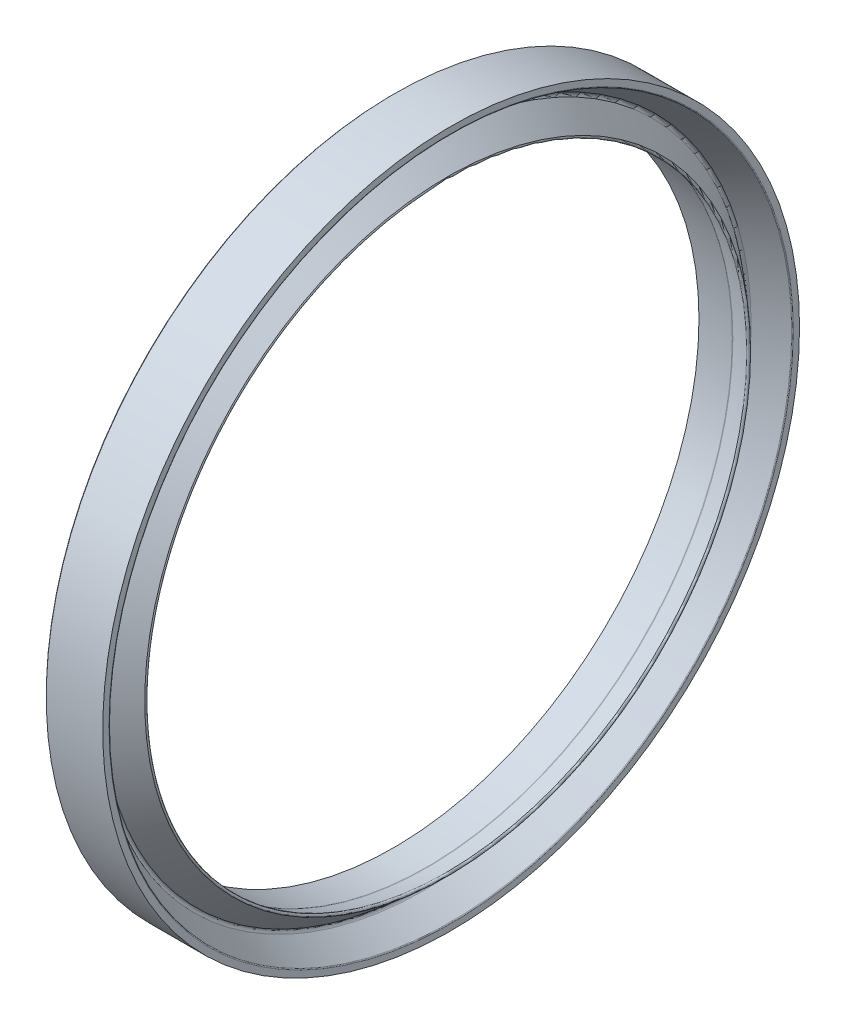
ISO-10303-21;
HEADER;
FILE_DESCRIPTION(('STEP AP214'),'2;1');
FILE_NAME('part.step','',(''),(''),'','','');
FILE_SCHEMA(('AUTOMOTIVE_DESIGN { 1 0 10303 214 1 1 1 1 }'));
ENDSEC;
DATA;
#1=APPLICATION_CONTEXT('core data for automotive mechanical design processes');
#2=APPLICATION_PROTOCOL_DEFINITION('international standard','automotive_design',2000,#1);
#3=PRODUCT_CONTEXT('',#1,'mechanical');
#4=PRODUCT('Part','Part','',(#3));
#5=PRODUCT_RELATED_PRODUCT_CATEGORY('part','',(#4));
#6=PRODUCT_DEFINITION_FORMATION('','',#4);
#7=PRODUCT_DEFINITION_CONTEXT('part definition',#1,'design');
#8=PRODUCT_DEFINITION('design','',#6,#7);
#9=PRODUCT_DEFINITION_SHAPE('','',#8);
#10=(LENGTH_UNIT() NAMED_UNIT(*) SI_UNIT(.MILLI.,.METRE.));
#11=(NAMED_UNIT(*) PLANE_ANGLE_UNIT() SI_UNIT($,.RADIAN.));
#12=(NAMED_UNIT(*) SI_UNIT($,.STERADIAN.) SOLID_ANGLE_UNIT());
#13=UNCERTAINTY_MEASURE_WITH_UNIT(LENGTH_MEASURE(1.E-05),#10,'distance_accuracy_value','');
#14=(GEOMETRIC_REPRESENTATION_CONTEXT(3) GLOBAL_UNCERTAINTY_ASSIGNED_CONTEXT((#13)) GLOBAL_UNIT_ASSIGNED_CONTEXT((#10,
#11,#12)) REPRESENTATION_CONTEXT('',''));
#15=CARTESIAN_POINT('',(0.,0.,0.));
#16=DIRECTION('',(0.,0.,1.));
#17=DIRECTION('',(1.,0.,0.));
#18=AXIS2_PLACEMENT_3D('',#15,#16,#17);
#19=CARTESIAN_POINT('',(-1.6123534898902,0.,0.));
#20=DIRECTION('',(1.,0.,0.));
#21=DIRECTION('',(0.,0.,-1.));
#22=AXIS2_PLACEMENT_3D('',#19,#20,#21);
#23=CYLINDRICAL_SURFACE('',#22,29.);
#24=CARTESIAN_POINT('',(-2.82937380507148,0.,0.));
#25=DIRECTION('',(1.,0.,0.));
#26=DIRECTION('',(0.,0.,-1.));
#27=AXIS2_PLACEMENT_3D('',#24,#25,#26);
#28=CIRCLE('',#27,29.);
#29=CARTESIAN_POINT('',(-2.82937380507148,0.,-29.));
#30=VERTEX_POINT('',#29);
#31=EDGE_CURVE('E10',#30,#30,#28,.T.);
#32=ORIENTED_EDGE('',*,*,#31,.F.);
#33=EDGE_LOOP('',(#32));
#34=FACE_BOUND('',#33,.T.);
#35=CARTESIAN_POINT('',(-7.52937380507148,0.,0.));
#36=DIRECTION('',(1.,0.,0.));
#37=DIRECTION('',(0.,0.,-1.));
#38=AXIS2_PLACEMENT_3D('',#35,#36,#37);
#39=CIRCLE('',#38,29.);
#40=CARTESIAN_POINT('',(-7.52937380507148,0.,-29.));
#41=VERTEX_POINT('',#40);
#42=EDGE_CURVE('E70',#41,#41,#39,.T.);
#43=ORIENTED_EDGE('',*,*,#42,.T.);
#44=EDGE_LOOP('',(#43));
#45=FACE_BOUND('',#44,.T.);
#46=ADVANCED_FACE('F30',(#34,#45),#23,.T.);
#47=CARTESIAN_POINT('',(-2.82937380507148,-29.,0.));
#48=DIRECTION('',(-1.,0.,0.));
#49=DIRECTION('',(0.,0.,1.));
#50=AXIS2_PLACEMENT_3D('',#47,#48,#49);
#51=PLANE('',#50);
#52=CARTESIAN_POINT('',(-2.82937380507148,0.,0.));
#53=DIRECTION('',(1.,0.,0.));
#54=DIRECTION('',(0.,0.,-1.));
#55=AXIS2_PLACEMENT_3D('',#52,#53,#54);
#56=CIRCLE('',#55,28.4814331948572);
#57=CARTESIAN_POINT('',(-2.82937380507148,0.,-28.4814331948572));
#58=VERTEX_POINT('',#57);
#59=EDGE_CURVE('E36',#58,#58,#56,.T.);
#60=ORIENTED_EDGE('',*,*,#59,.F.);
#61=EDGE_LOOP('',(#60));
#62=FACE_BOUND('',#61,.T.);
#63=ORIENTED_EDGE('',*,*,#31,.T.);
#64=EDGE_LOOP('',(#63));
#65=FACE_BOUND('',#64,.T.);
#66=ADVANCED_FACE('F131',(#62,#65),#51,.F.);
#67=CARTESIAN_POINT('',(-2.92937380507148,0.,0.));
#68=DIRECTION('',(1.,0.,0.));
#69=DIRECTION('',(0.,0.,-1.));
#70=AXIS2_PLACEMENT_3D('',#67,#68,#69);
#71=TOROIDAL_SURFACE('',#70,28.4814331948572,0.0999999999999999);
#72=CARTESIAN_POINT('',(-2.87937380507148,0.,0.));
#73=DIRECTION('',(1.,0.,0.));
#74=DIRECTION('',(0.,0.,-1.));
#75=AXIS2_PLACEMENT_3D('',#72,#73,#74);
#76=CIRCLE('',#75,28.3948306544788);
#77=CARTESIAN_POINT('',(-2.87937380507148,0.,-28.3948306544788));
#78=VERTEX_POINT('',#77);
#79=EDGE_CURVE('E40',#78,#78,#76,.T.);
#80=ORIENTED_EDGE('',*,*,#79,.F.);
#81=EDGE_LOOP('',(#80));
#82=FACE_BOUND('',#81,.T.);
#83=ORIENTED_EDGE('',*,*,#59,.T.);
#84=EDGE_LOOP('',(#83));
#85=FACE_BOUND('',#84,.T.);
#86=ADVANCED_FACE('F126',(#82,#85),#71,.T.);
#87=CARTESIAN_POINT('',(-2.87937380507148,0.,0.));
#88=DIRECTION('',(1.,0.,0.));
#89=DIRECTION('',(0.,0.,-1.));
#90=AXIS2_PLACEMENT_3D('',#87,#88,#89);
#91=CONICAL_SURFACE('',#90,28.3948306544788,0.523598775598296);
#92=CARTESIAN_POINT('',(-5.01881825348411,0.,0.));
#93=DIRECTION('',(1.,0.,0.));
#94=DIRECTION('',(0.,0.,-1.));
#95=AXIS2_PLACEMENT_3D('',#92,#93,#94);
#96=CIRCLE('',#95,27.1596218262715);
#97=CARTESIAN_POINT('',(-5.01881825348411,0.,-27.1596218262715));
#98=VERTEX_POINT('',#97);
#99=EDGE_CURVE('E44',#98,#98,#96,.T.);
#100=ORIENTED_EDGE('',*,*,#99,.F.);
#101=EDGE_LOOP('',(#100));
#102=FACE_BOUND('',#101,.T.);
#103=ORIENTED_EDGE('',*,*,#79,.T.);
#104=EDGE_LOOP('',(#103));
#105=FACE_BOUND('',#104,.T.);
#106=ADVANCED_FACE('F120',(#102,#105),#91,.F.);
#107=CARTESIAN_POINT('',(-4.91881825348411,0.,0.));
#108=DIRECTION('',(1.,0.,0.));
#109=DIRECTION('',(0.,0.,-1.));
#110=AXIS2_PLACEMENT_3D('',#107,#108,#109);
#111=TOROIDAL_SURFACE('',#110,26.9864167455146,0.200000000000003);
#112=CARTESIAN_POINT('',(-5.04737577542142,0.,0.));
#113=DIRECTION('',(1.,0.,0.));
#114=DIRECTION('',(0.,0.,-1.));
#115=AXIS2_PLACEMENT_3D('',#112,#113,#114);
#116=CIRCLE('',#115,26.8332078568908);
#117=CARTESIAN_POINT('',(-5.04737577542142,0.,-26.8332078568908));
#118=VERTEX_POINT('',#117);
#119=EDGE_CURVE('E49',#118,#118,#116,.T.);
#120=ORIENTED_EDGE('',*,*,#119,.F.);
#121=EDGE_LOOP('',(#120));
#122=FACE_BOUND('',#121,.T.);
#123=ORIENTED_EDGE('',*,*,#99,.T.);
#124=EDGE_LOOP('',(#123));
#125=FACE_BOUND('',#124,.T.);
#126=ADVANCED_FACE('F114',(#122,#125),#111,.F.);
#127=CARTESIAN_POINT('',(-5.04737577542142,0.,0.));
#128=DIRECTION('',(-1.,0.,0.));
#129=DIRECTION('',(0.,0.,1.));
#130=AXIS2_PLACEMENT_3D('',#127,#128,#129);
#131=CONICAL_SURFACE('',#130,26.8332078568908,0.698131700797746);
#132=CARTESIAN_POINT('',(-3.11788324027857,0.,0.));
#133=DIRECTION('',(1.,0.,0.));
#134=DIRECTION('',(0.,0.,-1.));
#135=AXIS2_PLACEMENT_3D('',#132,#133,#134);
#136=CIRCLE('',#135,25.2141713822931);
#137=CARTESIAN_POINT('',(-3.11788324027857,0.,-25.2141713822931));
#138=VERTEX_POINT('',#137);
#139=EDGE_CURVE('E52',#138,#138,#136,.T.);
#140=ORIENTED_EDGE('',*,*,#139,.F.);
#141=EDGE_LOOP('',(#140));
#142=FACE_BOUND('',#141,.T.);
#143=ORIENTED_EDGE('',*,*,#119,.T.);
#144=EDGE_LOOP('',(#143));
#145=FACE_BOUND('',#144,.T.);
#146=ADVANCED_FACE('F108',(#142,#145),#131,.T.);
#147=CARTESIAN_POINT('',(-3.19736884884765,0.,0.));
#148=DIRECTION('',(1.,0.,0.));
#149=DIRECTION('',(0.,0.,-1.));
#150=AXIS2_PLACEMENT_3D('',#147,#148,#149);
#151=TOROIDAL_SURFACE('',#150,25.1194441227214,0.123657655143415);
#152=CARTESIAN_POINT('',(-3.22937380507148,0.,0.));
#153=DIRECTION('',(1.,0.,0.));
#154=DIRECTION('',(0.,0.,-1.));
#155=AXIS2_PLACEMENT_3D('',#152,#153,#154);
#156=CIRCLE('',#155,25.);
#157=CARTESIAN_POINT('',(-3.22937380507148,0.,-25.));
#158=VERTEX_POINT('',#157);
#159=EDGE_CURVE('E55',#158,#158,#156,.T.);
#160=ORIENTED_EDGE('',*,*,#159,.F.);
#161=EDGE_LOOP('',(#160));
#162=FACE_BOUND('',#161,.T.);
#163=ORIENTED_EDGE('',*,*,#139,.T.);
#164=EDGE_LOOP('',(#163));
#165=FACE_BOUND('',#164,.T.);
#166=ADVANCED_FACE('F102',(#162,#165),#151,.T.);
#167=CARTESIAN_POINT('',(-3.22937380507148,0.,0.));
#168=DIRECTION('',(-1.,0.,0.));
#169=DIRECTION('',(0.,0.,1.));
#170=AXIS2_PLACEMENT_3D('',#167,#168,#169);
#171=CONICAL_SURFACE('',#170,25.,0.261799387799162);
#172=CARTESIAN_POINT('',(-4.80394049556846,0.,0.));
#173=DIRECTION('',(1.,0.,0.));
#174=DIRECTION('',(0.,0.,-1.));
#175=AXIS2_PLACEMENT_3D('',#172,#173,#174);
#176=CIRCLE('',#175,25.4219038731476);
#177=CARTESIAN_POINT('',(-4.80394049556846,0.,-25.4219038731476));
#178=VERTEX_POINT('',#177);
#179=EDGE_CURVE('E58',#178,#178,#176,.T.);
#180=ORIENTED_EDGE('',*,*,#179,.F.);
#181=EDGE_LOOP('',(#180));
#182=FACE_BOUND('',#181,.T.);
#183=ORIENTED_EDGE('',*,*,#159,.T.);
#184=EDGE_LOOP('',(#183));
#185=FACE_BOUND('',#184,.T.);
#186=ADVANCED_FACE('F96',(#182,#185),#171,.F.);
#187=CARTESIAN_POINT('',(-4.85570430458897,0.,0.));
#188=DIRECTION('',(1.,0.,0.));
#189=DIRECTION('',(0.,0.,-1.));
#190=AXIS2_PLACEMENT_3D('',#187,#188,#189);
#191=TOROIDAL_SURFACE('',#190,25.2287187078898,0.199999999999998);
#192=CARTESIAN_POINT('',(-4.85570430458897,0.,0.));
#193=DIRECTION('',(1.,0.,0.));
#194=DIRECTION('',(0.,0.,-1.));
#195=AXIS2_PLACEMENT_3D('',#192,#193,#194);
#196=CIRCLE('',#195,25.4287187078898);
#197=CARTESIAN_POINT('',(-4.85570430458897,0.,-25.4287187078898));
#198=VERTEX_POINT('',#197);
#199=EDGE_CURVE('E61',#198,#198,#196,.T.);
#200=ORIENTED_EDGE('',*,*,#199,.F.);
#201=EDGE_LOOP('',(#200));
#202=FACE_BOUND('',#201,.T.);
#203=ORIENTED_EDGE('',*,*,#179,.T.);
#204=EDGE_LOOP('',(#203));
#205=FACE_BOUND('',#204,.T.);
#206=ADVANCED_FACE('F90',(#202,#205),#191,.F.);
#207=CARTESIAN_POINT('',(-1.6123534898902,0.,0.));
#208=DIRECTION('',(1.,0.,0.));
#209=DIRECTION('',(0.,0.,-1.));
#210=AXIS2_PLACEMENT_3D('',#207,#208,#209);
#211=CYLINDRICAL_SURFACE('',#210,25.4287187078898);
#212=CARTESIAN_POINT('',(-7.62937380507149,0.,0.));
#213=DIRECTION('',(1.,0.,0.));
#214=DIRECTION('',(0.,0.,-1.));
#215=AXIS2_PLACEMENT_3D('',#212,#213,#214);
#216=CIRCLE('',#215,25.4287187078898);
#217=CARTESIAN_POINT('',(-7.62937380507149,0.,-25.4287187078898));
#218=VERTEX_POINT('',#217);
#219=EDGE_CURVE('E64',#218,#218,#216,.T.);
#220=ORIENTED_EDGE('',*,*,#219,.F.);
#221=EDGE_LOOP('',(#220));
#222=FACE_BOUND('',#221,.T.);
#223=ORIENTED_EDGE('',*,*,#199,.T.);
#224=EDGE_LOOP('',(#223));
#225=FACE_BOUND('',#224,.T.);
#226=ADVANCED_FACE('F84',(#222,#225),#211,.F.);
#227=CARTESIAN_POINT('',(-7.62937380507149,-28.9,0.));
#228=DIRECTION('',(1.,0.,0.));
#229=DIRECTION('',(0.,0.,-1.));
#230=AXIS2_PLACEMENT_3D('',#227,#228,#229);
#231=PLANE('',#230);
#232=CARTESIAN_POINT('',(-7.62937380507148,0.,0.));
#233=DIRECTION('',(1.,0.,0.));
#234=DIRECTION('',(0.,0.,-1.));
#235=AXIS2_PLACEMENT_3D('',#232,#233,#234);
#236=CIRCLE('',#235,28.9);
#237=CARTESIAN_POINT('',(-7.62937380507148,0.,-28.9));
#238=VERTEX_POINT('',#237);
#239=EDGE_CURVE('E67',#238,#238,#236,.T.);
#240=ORIENTED_EDGE('',*,*,#239,.F.);
#241=EDGE_LOOP('',(#240));
#242=FACE_BOUND('',#241,.T.);
#243=ORIENTED_EDGE('',*,*,#219,.T.);
#244=EDGE_LOOP('',(#243));
#245=FACE_BOUND('',#244,.T.);
#246=ADVANCED_FACE('F78',(#242,#245),#231,.F.);
#247=CARTESIAN_POINT('',(-7.62937380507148,0.,0.));
#248=DIRECTION('',(1.,0.,0.));
#249=DIRECTION('',(0.,0.,-1.));
#250=AXIS2_PLACEMENT_3D('',#247,#248,#249);
#251=CONICAL_SURFACE('',#250,28.9,0.785398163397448);
#252=ORIENTED_EDGE('',*,*,#42,.F.);
#253=EDGE_LOOP('',(#252));
#254=FACE_BOUND('',#253,.T.);
#255=ORIENTED_EDGE('',*,*,#239,.T.);
#256=EDGE_LOOP('',(#255));
#257=FACE_BOUND('',#256,.T.);
#258=ADVANCED_FACE('F75',(#254,#257),#251,.T.);
#259=CLOSED_SHELL('',(#46,#66,#86,#106,#126,#146,#166,#186,#206,#226,#246,#258));
#260=MANIFOLD_SOLID_BREP('B2',#259);
#261=ADVANCED_BREP_SHAPE_REPRESENTATION('',(#18,#260),#14);
#262=SHAPE_DEFINITION_REPRESENTATION(#9,#261);
ENDSEC;
END-ISO-10303-21;
